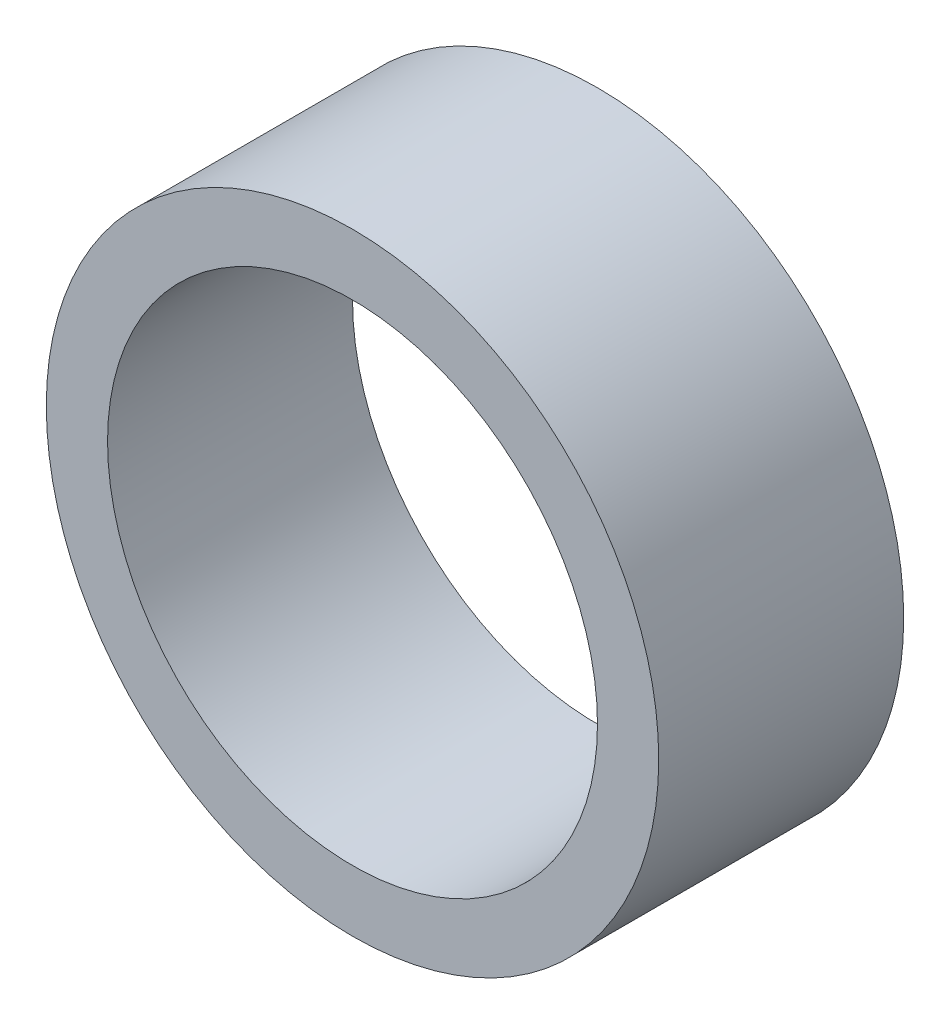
from build123d import *

# Parameters (mm, degrees)
LOGO3_BIB1_W = 1.5875
LOGO3_BIB1_H = 6.35


with BuildPart() as part:
    # Logo3_bib1 → Revolve1 (revolve)
    with BuildSketch(Plane(origin=(0, 0, 0), x_dir=(-1, 0, 0), z_dir=(0, -1, 0))):
        with Locations((7.14375, -3.175)):
            Rectangle(LOGO3_BIB1_W, LOGO3_BIB1_H)
    revolve(axis=Axis((0, 0, -38.976362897), (0, 0, 1)))


solid = part.part
